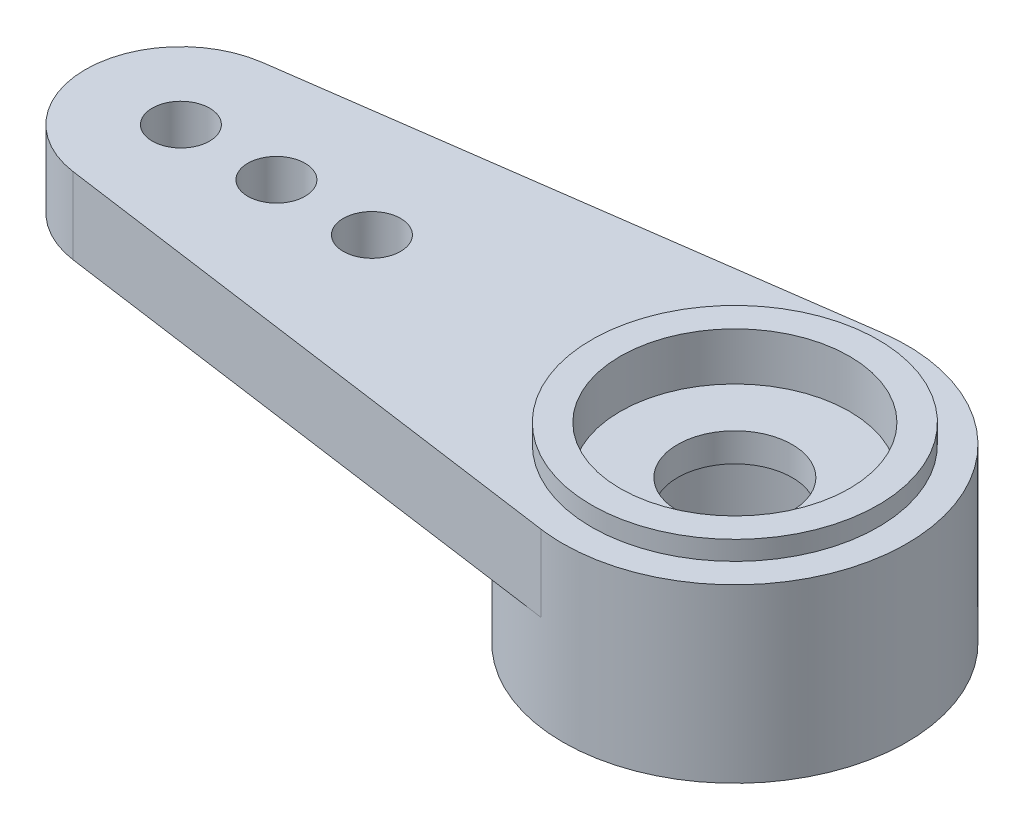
from build123d import *

# Parameters (mm, degrees)
SKICA2_R                      = 0.75
ODEBRAT_VYSUNUT_M1_DEPTH      = 25.45915
SKICA3_OUTSIDE_W              = 45.668
SKICA3_OUTSIDE_H              = 45.668
ODEBRAT_VYSUNUT_M2_DEPTH      = 25.45915
ODEBRAT_VYSUNUT_M3_DEPTH      = 18.76232
ODEBRAT_VYSUNUT_M3_DEPTH_BACK = 18.76232


with BuildPart() as part:
    # Skica1 → Z_klad-Rota_n (revolve)
    with BuildSketch(Plane.XY, mode=Mode.PRIVATE) as z_klad_rota_n_sk:
        Polygon((3, 0), (4.5, 0), (4.5, 2.5), (17, 2.5), (17, 4.5), (3.75, 4.5), (3.75, 5), (3, 5), (3, 3.75), (1.5, 3.75), (1.5, 3), (3, 3), align=None)
    revolve(z_klad_rota_n_sk.sketch.rotate(Axis((0, 9.56086, 0), (0, -1, 0)), 90), axis=Axis((0, 9.56086, 0), (0, -1, 0)))

    # Skica2 → Odebrat vysunut_m1 (cut, through all)
    with BuildSketch(Plane(origin=(0, 4.5, 0), x_dir=(-1, 0, 0), z_dir=(0, 1, 0))):
        with Locations(Location((-9.5, 0, 0), (0, 0, 90))):
            Circle(SKICA2_R)
        with Locations(Location((9.5, 0, 0), (0, 0, 90))):
            Circle(SKICA2_R)
        with Locations(Location((12, 0, 0), (0, 0, 90))):
            Circle(SKICA2_R)
        with Locations(Location((14.5, 0, 0), (0, 0, 90))):
            Circle(SKICA2_R)
        with Locations(Location((-14.5, 0, 0), (0, 0, 90))):
            Circle(SKICA2_R)
        with Locations(Location((-12, 0, 0), (0, 0, 90))):
            Circle(SKICA2_R)
    extrude(amount=-ODEBRAT_VYSUNUT_M1_DEPTH, mode=Mode.SUBTRACT)

    # Skica3 outside → Odebrat vysunut_m2 (cut, through all)
    with BuildSketch(Plane(origin=(0, 4.5, 0), x_dir=(-1, 0, 0), z_dir=(0, 1, 0))):
        Rectangle(SKICA3_OUTSIDE_W, SKICA3_OUTSIDE_H)
        with BuildLine():
            Line((-14.844828, -2.476105), (-0.62069, -4.456988))
            ThreePointArc((-0.62069, -4.456988), (0, -4.5), (0.62069, -4.456988))
            Line((0.62069, -4.456988), (14.844828, -2.476105))
            ThreePointArc((14.844828, -2.476105), (17, 0), (14.844828, 2.476105))
            Line((14.844828, 2.476105), (0.62069, 4.456988))
            ThreePointArc((0.62069, 4.456988), (0, 4.5), (-0.62069, 4.456988))
            Line((-0.62069, 4.456988), (-14.844828, 2.476105))
            ThreePointArc((-14.844828, 2.476105), (-17, 0), (-14.844828, -2.476105))
        make_face(mode=Mode.SUBTRACT)
    extrude(amount=-ODEBRAT_VYSUNUT_M2_DEPTH, mode=Mode.SUBTRACT)

    # Skica4 → Odebrat vysunut_m3 (cut, two sides: drawn at the far end of the back side and taken through both)
    with BuildSketch(Plane.XZ.offset(-2.5).offset(-ODEBRAT_VYSUNUT_M3_DEPTH_BACK)):
        with BuildLine():
            Line((-48.438957, -11.289139), (0.62069, -4.456988))
            ThreePointArc((0.62069, -4.456988), (4.5, 0), (0.62069, 4.456988))
            Line((0.62069, 4.456988), (-48.438957, 11.289139))
            Line((-48.438957, 11.289139), (50.627227, 11.289139))
            Line((50.627227, 11.289139), (50.627227, -11.289139))
            Line((50.627227, -11.289139), (-48.438957, -11.289139))
        make_face()
    extrude(amount=ODEBRAT_VYSUNUT_M3_DEPTH + ODEBRAT_VYSUNUT_M3_DEPTH_BACK, mode=Mode.SUBTRACT)


solid = part.part
